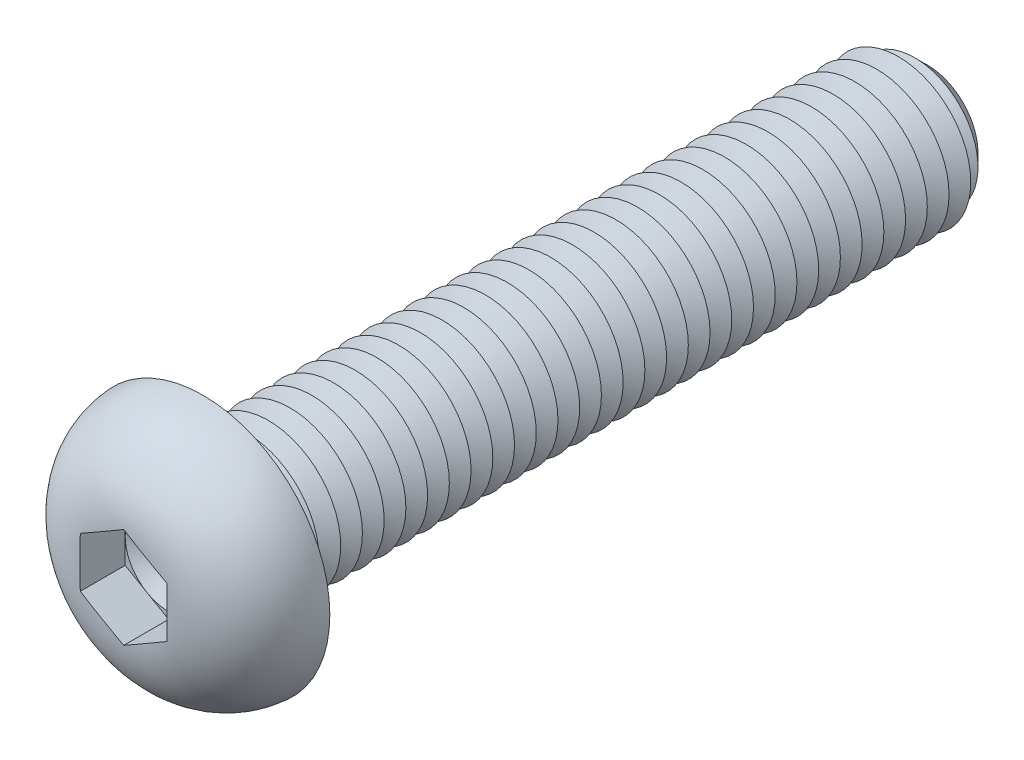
from build123d import *

# Parameters (mm, degrees)
CUT_EXTRUDE1_DEPTH  = 3.12
SKETCH4_R           = 5
BOSS_EXTRUDE1_DEPTH = 50
CHAMFER1_SIZE       = 1.5
LPATTERN1_COUNT     = 32
LPATTERN1_PITCH     = 1.5
FILLET2_R           = 0.6


with BuildPart() as part:
    # Sketch2 → Revolve1 (revolve)
    with BuildSketch(Plane(origin=(0, 0, 0), x_dir=(0, 0, -1), z_dir=(1, 0, 0)), mode=Mode.PRIVATE) as revolve1_sk:
        with BuildLine():
            Line((0, 0), (-5.5, 0))
            Line((-5.5, 0), (-5.5, 2.957763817))
            ThreePointArc((-5.5, 2.957763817), (-3.905948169, 6.951508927), (0, 8.75))
            Line((0, 8.75), (0, 0))
        make_face()
    revolve(revolve1_sk.sketch.rotate(Axis((0, 0, 47.934239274), (0, 0, -1)), 90), axis=Axis((0, 0, 47.934239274), (0, 0, -1)))

    # Sketch3 → Cut-Extrude1 (cut)
    with BuildSketch(Plane.XY.offset(5.5)):
        Polygon((0, 3.464101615), (-3, 1.732050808), (-3, -1.732050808), (0, -3.464101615), (3, -1.732050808), (3, 1.732050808), align=None)
    extrude(amount=-CUT_EXTRUDE1_DEPTH, mode=Mode.SUBTRACT)

    # Sketch4 → Boss-Extrude1 (add)
    with BuildSketch(Plane(origin=(0, 0, 0), x_dir=(-1, 0, 0), z_dir=(0, 0, -1))):
        with Locations(Location((0, 0, 0), (0, 0, 180))):
            Circle(SKETCH4_R)
    extrude(amount=BOSS_EXTRUDE1_DEPTH)

    # Chamfer1
    chamfer1_edges = [part.edges().sort_by_distance(p)[0] for p in [
        (-5, 0, -50),
    ]]
    chamfer(chamfer1_edges, length=CHAMFER1_SIZE)

    # Sketch5 → Cut-Revolve1 (revolve, cut)
    with BuildSketch(Plane(origin=(0, 0, 0), x_dir=(0, 0, -1), z_dir=(1, 0, 0)), mode=Mode.PRIVATE) as cut_revolve1_sk:
        Polygon((1.5, 5), (3, 5), (2.25, 3.700961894), align=None)
    cut_revolve1 = revolve(cut_revolve1_sk.sketch.rotate(Axis((0, 0, 47.934239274), (0, 0, -1)), 90), axis=Axis((0, 0, 47.934239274), (0, 0, -1)), mode=Mode.SUBTRACT)

    # LPattern1: Cut-Revolve1 ×32
    with Locations(*[(0, 0, -i * LPATTERN1_PITCH) for i in range(1, LPATTERN1_COUNT)]):
        add(cut_revolve1, mode=Mode.SUBTRACT)

    # Fillet2
    fillet2_edges = [part.edges().sort_by_distance(p)[0] for p in [
        (-5, 0, 0),
    ]]
    fillet(fillet2_edges, radius=FILLET2_R)

    # Cut-Extrude2 cone 1 section (on through the dimple's axis) → Cut-Extrude2 (revolve, cut)
    with BuildSketch(Plane(origin=(0, 0, 2.38), x_dir=(0, -1, 0), z_dir=(1, 0, 0))):
        Polygon((0, 0), (3, 0), (0, 1.732050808), align=None)
    revolve(axis=Axis((0, 0, 2.38), (0, 0, -1)), mode=Mode.SUBTRACT)


solid = part.part
